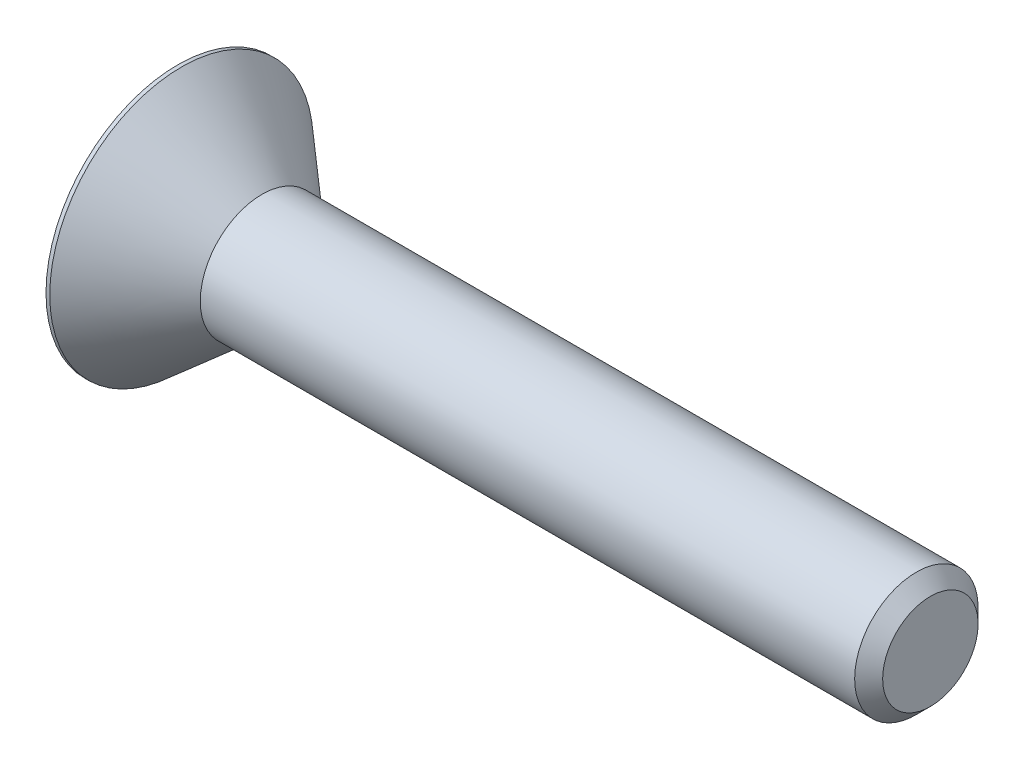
ISO-10303-21;
HEADER;
FILE_DESCRIPTION(('STEP AP214'),'2;1');
FILE_NAME('part.step','',(''),(''),'','','');
FILE_SCHEMA(('AUTOMOTIVE_DESIGN { 1 0 10303 214 1 1 1 1 }'));
ENDSEC;
DATA;
#1=APPLICATION_CONTEXT('core data for automotive mechanical design processes');
#2=APPLICATION_PROTOCOL_DEFINITION('international standard','automotive_design',2000,#1);
#3=PRODUCT_CONTEXT('',#1,'mechanical');
#4=PRODUCT('Part','Part','',(#3));
#5=PRODUCT_RELATED_PRODUCT_CATEGORY('part','',(#4));
#6=PRODUCT_DEFINITION_FORMATION('','',#4);
#7=PRODUCT_DEFINITION_CONTEXT('part definition',#1,'design');
#8=PRODUCT_DEFINITION('design','',#6,#7);
#9=PRODUCT_DEFINITION_SHAPE('','',#8);
#10=(LENGTH_UNIT() NAMED_UNIT(*) SI_UNIT(.MILLI.,.METRE.));
#11=(NAMED_UNIT(*) PLANE_ANGLE_UNIT() SI_UNIT($,.RADIAN.));
#12=(NAMED_UNIT(*) SI_UNIT($,.STERADIAN.) SOLID_ANGLE_UNIT());
#13=UNCERTAINTY_MEASURE_WITH_UNIT(LENGTH_MEASURE(1.E-05),#10,'distance_accuracy_value','');
#14=(GEOMETRIC_REPRESENTATION_CONTEXT(3) GLOBAL_UNCERTAINTY_ASSIGNED_CONTEXT((#13)) GLOBAL_UNIT_ASSIGNED_CONTEXT((#10,
#11,#12)) REPRESENTATION_CONTEXT('',''));
#15=CARTESIAN_POINT('',(0.,0.,0.));
#16=DIRECTION('',(0.,0.,1.));
#17=DIRECTION('',(1.,0.,0.));
#18=AXIS2_PLACEMENT_3D('',#15,#16,#17);
#19=CARTESIAN_POINT('',(0.,0.,0.));
#20=DIRECTION('',(-1.,0.,0.));
#21=DIRECTION('',(0.,0.,1.));
#22=AXIS2_PLACEMENT_3D('',#19,#20,#21);
#23=PLANE('',#22);
#24=CARTESIAN_POINT('',(0.,0.,0.));
#25=DIRECTION('',(-1.,0.,0.));
#26=DIRECTION('',(0.,0.,1.));
#27=AXIS2_PLACEMENT_3D('',#24,#25,#26);
#28=CIRCLE('',#27,4.445);
#29=CARTESIAN_POINT('',(0.,0.,4.445));
#30=VERTEX_POINT('',#29);
#31=EDGE_CURVE('E11',#30,#30,#28,.T.);
#32=ORIENTED_EDGE('',*,*,#31,.T.);
#33=EDGE_LOOP('',(#32));
#34=FACE_BOUND('',#33,.T.);
#35=DIRECTION('',(0.,-0.5,-0.866025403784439));
#36=VECTOR('',#35,1.);
#37=CARTESIAN_POINT('',(0.,-0.689240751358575,1.1938));
#38=LINE('',#37,#36);
#39=CARTESIAN_POINT('',(0.,-0.689240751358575,1.1938));
#40=VERTEX_POINT('',#39);
#41=CARTESIAN_POINT('',(0.,-1.37848150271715,0.));
#42=VERTEX_POINT('',#41);
#43=EDGE_CURVE('E116',#40,#42,#38,.T.);
#44=ORIENTED_EDGE('',*,*,#43,.T.);
#45=DIRECTION('',(0.,0.5,-0.866025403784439));
#46=VECTOR('',#45,1.);
#47=CARTESIAN_POINT('',(0.,-1.37848150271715,0.));
#48=LINE('',#47,#46);
#49=CARTESIAN_POINT('',(0.,-0.689240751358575,-1.1938));
#50=VERTEX_POINT('',#49);
#51=EDGE_CURVE('E47',#42,#50,#48,.T.);
#52=ORIENTED_EDGE('',*,*,#51,.T.);
#53=DIRECTION('',(0.,1.,0.));
#54=VECTOR('',#53,1.);
#55=CARTESIAN_POINT('',(0.,-0.689240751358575,-1.1938));
#56=LINE('',#55,#54);
#57=CARTESIAN_POINT('',(0.,0.689240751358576,-1.1938));
#58=VERTEX_POINT('',#57);
#59=EDGE_CURVE('E127',#50,#58,#56,.T.);
#60=ORIENTED_EDGE('',*,*,#59,.T.);
#61=DIRECTION('',(0.,0.5,0.866025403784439));
#62=VECTOR('',#61,1.);
#63=CARTESIAN_POINT('',(0.,0.689240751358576,-1.1938));
#64=LINE('',#63,#62);
#65=CARTESIAN_POINT('',(0.,1.37848150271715,0.));
#66=VERTEX_POINT('',#65);
#67=EDGE_CURVE('E198',#58,#66,#64,.T.);
#68=ORIENTED_EDGE('',*,*,#67,.T.);
#69=DIRECTION('',(0.,-0.5,0.866025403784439));
#70=VECTOR('',#69,1.);
#71=CARTESIAN_POINT('',(0.,1.37848150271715,0.));
#72=LINE('',#71,#70);
#73=CARTESIAN_POINT('',(0.,0.689240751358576,1.1938));
#74=VERTEX_POINT('',#73);
#75=EDGE_CURVE('E181',#66,#74,#72,.T.);
#76=ORIENTED_EDGE('',*,*,#75,.T.);
#77=DIRECTION('',(0.,-1.,0.));
#78=VECTOR('',#77,1.);
#79=CARTESIAN_POINT('',(0.,0.689240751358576,1.1938));
#80=LINE('',#79,#78);
#81=EDGE_CURVE('E176',#74,#40,#80,.T.);
#82=ORIENTED_EDGE('',*,*,#81,.T.);
#83=EDGE_LOOP('',(#44,#52,#60,#68,#76,#82));
#84=FACE_BOUND('',#83,.T.);
#85=ADVANCED_FACE('F33',(#34,#84),#23,.T.);
#86=CARTESIAN_POINT('',(0.,0.,0.));
#87=DIRECTION('',(-1.,0.,0.));
#88=DIRECTION('',(0.,0.,1.));
#89=AXIS2_PLACEMENT_3D('',#86,#87,#88);
#90=CYLINDRICAL_SURFACE('',#89,4.445);
#91=CARTESIAN_POINT('',(0.127,0.,0.));
#92=DIRECTION('',(-1.,0.,0.));
#93=DIRECTION('',(0.,0.,1.));
#94=AXIS2_PLACEMENT_3D('',#91,#92,#93);
#95=CIRCLE('',#94,4.445);
#96=CARTESIAN_POINT('',(0.127,0.,4.445));
#97=VERTEX_POINT('',#96);
#98=EDGE_CURVE('E40',#97,#97,#95,.T.);
#99=ORIENTED_EDGE('',*,*,#98,.T.);
#100=EDGE_LOOP('',(#99));
#101=FACE_BOUND('',#100,.T.);
#102=ORIENTED_EDGE('',*,*,#31,.F.);
#103=EDGE_LOOP('',(#102));
#104=FACE_BOUND('',#103,.T.);
#105=ADVANCED_FACE('F152',(#101,#104),#90,.T.);
#106=CARTESIAN_POINT('',(0.127,0.,0.));
#107=DIRECTION('',(-1.,0.,0.));
#108=DIRECTION('',(0.,0.,1.));
#109=AXIS2_PLACEMENT_3D('',#106,#107,#108);
#110=CONICAL_SURFACE('',#109,4.445,0.715584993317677);
#111=CARTESIAN_POINT('',(2.84440025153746,0.,0.));
#112=DIRECTION('',(-1.,0.,0.));
#113=DIRECTION('',(0.,0.,1.));
#114=AXIS2_PLACEMENT_3D('',#111,#112,#113);
#115=CIRCLE('',#114,2.0828);
#116=CARTESIAN_POINT('',(2.84440025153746,0.,2.0828));
#117=VERTEX_POINT('',#116);
#118=EDGE_CURVE('E147',#117,#117,#115,.T.);
#119=ORIENTED_EDGE('',*,*,#118,.T.);
#120=EDGE_LOOP('',(#119));
#121=FACE_BOUND('',#120,.T.);
#122=ORIENTED_EDGE('',*,*,#98,.F.);
#123=EDGE_LOOP('',(#122));
#124=FACE_BOUND('',#123,.T.);
#125=ADVANCED_FACE('F155',(#121,#124),#110,.T.);
#126=CARTESIAN_POINT('',(0.,0.,0.));
#127=DIRECTION('',(-1.,0.,0.));
#128=DIRECTION('',(0.,0.,1.));
#129=AXIS2_PLACEMENT_3D('',#126,#127,#128);
#130=CYLINDRICAL_SURFACE('',#129,2.08279999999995);
#131=CARTESIAN_POINT('',(24.9275599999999,0.,0.));
#132=DIRECTION('',(-1.,0.,0.));
#133=DIRECTION('',(0.,0.,1.));
#134=AXIS2_PLACEMENT_3D('',#131,#132,#133);
#135=CIRCLE('',#134,2.08279999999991);
#136=CARTESIAN_POINT('',(24.9275599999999,0.,2.08279999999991));
#137=VERTEX_POINT('',#136);
#138=EDGE_CURVE('E144',#137,#137,#135,.T.);
#139=ORIENTED_EDGE('',*,*,#138,.T.);
#140=EDGE_LOOP('',(#139));
#141=FACE_BOUND('',#140,.T.);
#142=ORIENTED_EDGE('',*,*,#118,.F.);
#143=EDGE_LOOP('',(#142));
#144=FACE_BOUND('',#143,.T.);
#145=ADVANCED_FACE('F157',(#141,#144),#130,.T.);
#146=CARTESIAN_POINT('',(25.4,0.,0.));
#147=DIRECTION('',(-1.,0.,0.));
#148=DIRECTION('',(0.,0.,1.));
#149=AXIS2_PLACEMENT_3D('',#146,#147,#148);
#150=CONICAL_SURFACE('',#149,1.61036,0.785398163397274);
#151=ORIENTED_EDGE('',*,*,#138,.F.);
#152=EDGE_LOOP('',(#151));
#153=FACE_BOUND('',#152,.T.);
#154=CARTESIAN_POINT('',(25.4,0.,0.));
#155=DIRECTION('',(-1.,0.,0.));
#156=DIRECTION('',(0.,0.,1.));
#157=AXIS2_PLACEMENT_3D('',#154,#155,#156);
#158=CIRCLE('',#157,1.61036);
#159=CARTESIAN_POINT('',(25.4,0.,1.61036));
#160=VERTEX_POINT('',#159);
#161=EDGE_CURVE('E140',#160,#160,#158,.T.);
#162=ORIENTED_EDGE('',*,*,#161,.T.);
#163=EDGE_LOOP('',(#162));
#164=FACE_BOUND('',#163,.T.);
#165=ADVANCED_FACE('F164',(#153,#164),#150,.T.);
#166=CARTESIAN_POINT('',(25.4,1.61036,0.));
#167=DIRECTION('',(1.,0.,0.));
#168=DIRECTION('',(0.,0.,-1.));
#169=AXIS2_PLACEMENT_3D('',#166,#167,#168);
#170=PLANE('',#169);
#171=ORIENTED_EDGE('',*,*,#161,.F.);
#172=EDGE_LOOP('',(#171));
#173=FACE_BOUND('',#172,.T.);
#174=ADVANCED_FACE('F264',(#173),#170,.T.);
#175=CARTESIAN_POINT('',(1.9304,-1.37848150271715,0.));
#176=DIRECTION('',(0.,0.866025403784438,0.5));
#177=DIRECTION('',(0.,-0.5,0.866025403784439));
#178=AXIS2_PLACEMENT_3D('',#175,#176,#177);
#179=PLANE('',#178);
#180=ORIENTED_EDGE('',*,*,#51,.F.);
#181=DIRECTION('',(-1.,0.,0.));
#182=VECTOR('',#181,1.);
#183=CARTESIAN_POINT('',(1.9304,-1.37848150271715,0.));
#184=LINE('',#183,#182);
#185=CARTESIAN_POINT('',(1.9304,-1.37848150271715,0.));
#186=VERTEX_POINT('',#185);
#187=EDGE_CURVE('E185',#186,#42,#184,.T.);
#188=ORIENTED_EDGE('',*,*,#187,.F.);
#189=DIRECTION('',(0.,0.5,-0.866025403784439));
#190=VECTOR('',#189,1.);
#191=CARTESIAN_POINT('',(1.9304,-1.37848150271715,0.));
#192=LINE('',#191,#190);
#193=CARTESIAN_POINT('',(1.9304,-1.03386112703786,-0.5969));
#194=VERTEX_POINT('',#193);
#195=EDGE_CURVE('E112',#186,#194,#192,.T.);
#196=ORIENTED_EDGE('',*,*,#195,.T.);
#197=CARTESIAN_POINT('',(1.9304,-0.689240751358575,-1.1938));
#198=VERTEX_POINT('',#197);
#199=EDGE_CURVE('E108',#194,#198,#192,.T.);
#200=ORIENTED_EDGE('',*,*,#199,.T.);
#201=DIRECTION('',(-1.,0.,0.));
#202=VECTOR('',#201,1.);
#203=CARTESIAN_POINT('',(1.9304,-0.689240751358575,-1.1938));
#204=LINE('',#203,#202);
#205=EDGE_CURVE('E110',#198,#50,#204,.T.);
#206=ORIENTED_EDGE('',*,*,#205,.T.);
#207=EDGE_LOOP('',(#180,#188,#196,#200,#206));
#208=FACE_BOUND('',#207,.T.);
#209=ADVANCED_FACE('F109',(#208),#179,.T.);
#210=CARTESIAN_POINT('',(1.9304,-0.689240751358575,-1.1938));
#211=DIRECTION('',(0.,0.,1.));
#212=DIRECTION('',(1.,0.,0.));
#213=AXIS2_PLACEMENT_3D('',#210,#211,#212);
#214=PLANE('',#213);
#215=ORIENTED_EDGE('',*,*,#59,.F.);
#216=ORIENTED_EDGE('',*,*,#205,.F.);
#217=DIRECTION('',(0.,1.,0.));
#218=VECTOR('',#217,1.);
#219=CARTESIAN_POINT('',(1.9304,-0.689240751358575,-1.1938));
#220=LINE('',#219,#218);
#221=CARTESIAN_POINT('',(1.9304,0.,-1.1938));
#222=VERTEX_POINT('',#221);
#223=EDGE_CURVE('E55',#198,#222,#220,.T.);
#224=ORIENTED_EDGE('',*,*,#223,.T.);
#225=CARTESIAN_POINT('',(1.9304,0.689240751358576,-1.1938));
#226=VERTEX_POINT('',#225);
#227=EDGE_CURVE('E122',#222,#226,#220,.T.);
#228=ORIENTED_EDGE('',*,*,#227,.T.);
#229=DIRECTION('',(-1.,0.,0.));
#230=VECTOR('',#229,1.);
#231=CARTESIAN_POINT('',(1.9304,0.689240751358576,-1.1938));
#232=LINE('',#231,#230);
#233=EDGE_CURVE('E129',#226,#58,#232,.T.);
#234=ORIENTED_EDGE('',*,*,#233,.T.);
#235=EDGE_LOOP('',(#215,#216,#224,#228,#234));
#236=FACE_BOUND('',#235,.T.);
#237=ADVANCED_FACE('F124',(#236),#214,.T.);
#238=CARTESIAN_POINT('',(1.9304,0.689240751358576,-1.1938));
#239=DIRECTION('',(0.,-0.866025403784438,0.5));
#240=DIRECTION('',(0.,-0.5,-0.866025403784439));
#241=AXIS2_PLACEMENT_3D('',#238,#239,#240);
#242=PLANE('',#241);
#243=ORIENTED_EDGE('',*,*,#67,.F.);
#244=ORIENTED_EDGE('',*,*,#233,.F.);
#245=DIRECTION('',(0.,0.5,0.866025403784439));
#246=VECTOR('',#245,1.);
#247=CARTESIAN_POINT('',(1.9304,0.689240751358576,-1.1938));
#248=LINE('',#247,#246);
#249=CARTESIAN_POINT('',(1.9304,1.03386112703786,-0.5969));
#250=VERTEX_POINT('',#249);
#251=EDGE_CURVE('E218',#226,#250,#248,.T.);
#252=ORIENTED_EDGE('',*,*,#251,.T.);
#253=CARTESIAN_POINT('',(1.9304,1.37848150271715,0.));
#254=VERTEX_POINT('',#253);
#255=EDGE_CURVE('E121',#250,#254,#248,.T.);
#256=ORIENTED_EDGE('',*,*,#255,.T.);
#257=DIRECTION('',(-1.,0.,0.));
#258=VECTOR('',#257,1.);
#259=CARTESIAN_POINT('',(1.9304,1.37848150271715,0.));
#260=LINE('',#259,#258);
#261=EDGE_CURVE('E135',#254,#66,#260,.T.);
#262=ORIENTED_EDGE('',*,*,#261,.T.);
#263=EDGE_LOOP('',(#243,#244,#252,#256,#262));
#264=FACE_BOUND('',#263,.T.);
#265=ADVANCED_FACE('F196',(#264),#242,.T.);
#266=CARTESIAN_POINT('',(1.9304,1.37848150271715,0.));
#267=DIRECTION('',(0.,-0.866025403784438,-0.5));
#268=DIRECTION('',(0.,0.5,-0.866025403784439));
#269=AXIS2_PLACEMENT_3D('',#266,#267,#268);
#270=PLANE('',#269);
#271=ORIENTED_EDGE('',*,*,#75,.F.);
#272=ORIENTED_EDGE('',*,*,#261,.F.);
#273=DIRECTION('',(0.,-0.5,0.866025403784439));
#274=VECTOR('',#273,1.);
#275=CARTESIAN_POINT('',(1.9304,1.37848150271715,0.));
#276=LINE('',#275,#274);
#277=CARTESIAN_POINT('',(1.9304,1.03386112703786,0.5969));
#278=VERTEX_POINT('',#277);
#279=EDGE_CURVE('E215',#254,#278,#276,.T.);
#280=ORIENTED_EDGE('',*,*,#279,.T.);
#281=CARTESIAN_POINT('',(1.9304,0.689240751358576,1.1938));
#282=VERTEX_POINT('',#281);
#283=EDGE_CURVE('E217',#278,#282,#276,.T.);
#284=ORIENTED_EDGE('',*,*,#283,.T.);
#285=DIRECTION('',(-1.,0.,0.));
#286=VECTOR('',#285,1.);
#287=CARTESIAN_POINT('',(1.9304,0.689240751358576,1.1938));
#288=LINE('',#287,#286);
#289=EDGE_CURVE('E190',#282,#74,#288,.T.);
#290=ORIENTED_EDGE('',*,*,#289,.T.);
#291=EDGE_LOOP('',(#271,#272,#280,#284,#290));
#292=FACE_BOUND('',#291,.T.);
#293=ADVANCED_FACE('F228',(#292),#270,.T.);
#294=CARTESIAN_POINT('',(1.9304,0.689240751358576,1.1938));
#295=DIRECTION('',(0.,0.,-1.));
#296=DIRECTION('',(-1.,0.,0.));
#297=AXIS2_PLACEMENT_3D('',#294,#295,#296);
#298=PLANE('',#297);
#299=ORIENTED_EDGE('',*,*,#81,.F.);
#300=ORIENTED_EDGE('',*,*,#289,.F.);
#301=DIRECTION('',(0.,-1.,0.));
#302=VECTOR('',#301,1.);
#303=CARTESIAN_POINT('',(1.9304,0.689240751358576,1.1938));
#304=LINE('',#303,#302);
#305=CARTESIAN_POINT('',(1.9304,0.,1.1938));
#306=VERTEX_POINT('',#305);
#307=EDGE_CURVE('E211',#282,#306,#304,.T.);
#308=ORIENTED_EDGE('',*,*,#307,.T.);
#309=CARTESIAN_POINT('',(1.9304,-0.689240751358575,1.1938));
#310=VERTEX_POINT('',#309);
#311=EDGE_CURVE('E214',#306,#310,#304,.T.);
#312=ORIENTED_EDGE('',*,*,#311,.T.);
#313=DIRECTION('',(-1.,0.,0.));
#314=VECTOR('',#313,1.);
#315=CARTESIAN_POINT('',(1.9304,-0.689240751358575,1.1938));
#316=LINE('',#315,#314);
#317=EDGE_CURVE('E187',#310,#40,#316,.T.);
#318=ORIENTED_EDGE('',*,*,#317,.T.);
#319=EDGE_LOOP('',(#299,#300,#308,#312,#318));
#320=FACE_BOUND('',#319,.T.);
#321=ADVANCED_FACE('F241',(#320),#298,.T.);
#322=CARTESIAN_POINT('',(1.9304,-0.689240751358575,1.1938));
#323=DIRECTION('',(0.,0.866025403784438,-0.5));
#324=DIRECTION('',(0.,0.5,0.866025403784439));
#325=AXIS2_PLACEMENT_3D('',#322,#323,#324);
#326=PLANE('',#325);
#327=ORIENTED_EDGE('',*,*,#43,.F.);
#328=ORIENTED_EDGE('',*,*,#317,.F.);
#329=DIRECTION('',(0.,-0.5,-0.866025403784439));
#330=VECTOR('',#329,1.);
#331=CARTESIAN_POINT('',(1.9304,-0.689240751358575,1.1938));
#332=LINE('',#331,#330);
#333=CARTESIAN_POINT('',(1.9304,-1.03386112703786,0.5969));
#334=VERTEX_POINT('',#333);
#335=EDGE_CURVE('E188',#310,#334,#332,.T.);
#336=ORIENTED_EDGE('',*,*,#335,.T.);
#337=EDGE_CURVE('E210',#334,#186,#332,.T.);
#338=ORIENTED_EDGE('',*,*,#337,.T.);
#339=ORIENTED_EDGE('',*,*,#187,.T.);
#340=EDGE_LOOP('',(#327,#328,#336,#338,#339));
#341=FACE_BOUND('',#340,.T.);
#342=ADVANCED_FACE('F242',(#341),#326,.T.);
#343=CARTESIAN_POINT('',(1.9304,0.,-2.3876));
#344=DIRECTION('',(1.,0.,0.));
#345=DIRECTION('',(0.,0.,-1.));
#346=AXIS2_PLACEMENT_3D('',#343,#344,#345);
#347=PLANE('',#346);
#348=ORIENTED_EDGE('',*,*,#223,.F.);
#349=ORIENTED_EDGE('',*,*,#199,.F.);
#350=CARTESIAN_POINT('',(1.9304,0.,0.));
#351=DIRECTION('',(-1.,0.,0.));
#352=DIRECTION('',(0.,0.,1.));
#353=AXIS2_PLACEMENT_3D('',#350,#351,#352);
#354=CIRCLE('',#353,1.1938);
#355=EDGE_CURVE('E119',#222,#194,#354,.T.);
#356=ORIENTED_EDGE('',*,*,#355,.F.);
#357=EDGE_LOOP('',(#348,#349,#356));
#358=FACE_BOUND('',#357,.T.);
#359=ADVANCED_FACE('F118',(#358),#347,.F.);
#360=ORIENTED_EDGE('',*,*,#195,.F.);
#361=ORIENTED_EDGE('',*,*,#337,.F.);
#362=EDGE_CURVE('E132',#194,#334,#354,.T.);
#363=ORIENTED_EDGE('',*,*,#362,.F.);
#364=EDGE_LOOP('',(#360,#361,#363));
#365=FACE_BOUND('',#364,.T.);
#366=ADVANCED_FACE('F244',(#365),#347,.F.);
#367=ORIENTED_EDGE('',*,*,#335,.F.);
#368=ORIENTED_EDGE('',*,*,#311,.F.);
#369=EDGE_CURVE('E128',#334,#306,#354,.T.);
#370=ORIENTED_EDGE('',*,*,#369,.F.);
#371=EDGE_LOOP('',(#367,#368,#370));
#372=FACE_BOUND('',#371,.T.);
#373=ADVANCED_FACE('F238',(#372),#347,.F.);
#374=ORIENTED_EDGE('',*,*,#307,.F.);
#375=ORIENTED_EDGE('',*,*,#283,.F.);
#376=EDGE_CURVE('E134',#306,#278,#354,.T.);
#377=ORIENTED_EDGE('',*,*,#376,.F.);
#378=EDGE_LOOP('',(#374,#375,#377));
#379=FACE_BOUND('',#378,.T.);
#380=ADVANCED_FACE('F235',(#379),#347,.F.);
#381=ORIENTED_EDGE('',*,*,#279,.F.);
#382=ORIENTED_EDGE('',*,*,#255,.F.);
#383=EDGE_CURVE('E141',#278,#250,#354,.T.);
#384=ORIENTED_EDGE('',*,*,#383,.F.);
#385=EDGE_LOOP('',(#381,#382,#384));
#386=FACE_BOUND('',#385,.T.);
#387=ADVANCED_FACE('F226',(#386),#347,.F.);
#388=ORIENTED_EDGE('',*,*,#251,.F.);
#389=ORIENTED_EDGE('',*,*,#227,.F.);
#390=EDGE_CURVE('E223',#250,#222,#354,.T.);
#391=ORIENTED_EDGE('',*,*,#390,.F.);
#392=EDGE_LOOP('',(#388,#389,#391));
#393=FACE_BOUND('',#392,.T.);
#394=ADVANCED_FACE('F222',(#393),#347,.F.);
#395=CARTESIAN_POINT('',(1.9304,0.,0.));
#396=DIRECTION('',(-1.,0.,0.));
#397=DIRECTION('',(0.,0.,1.));
#398=AXIS2_PLACEMENT_3D('',#395,#396,#397);
#399=CONICAL_SURFACE('',#398,1.1938,1.04719755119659);
#400=CARTESIAN_POINT('',(2.61964075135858,0.,0.));
#401=VERTEX_POINT('',#400);
#402=VERTEX_LOOP('',#401);
#403=FACE_BOUND('',#402,.T.);
#404=ORIENTED_EDGE('',*,*,#376,.T.);
#405=ORIENTED_EDGE('',*,*,#383,.T.);
#406=ORIENTED_EDGE('',*,*,#390,.T.);
#407=ORIENTED_EDGE('',*,*,#355,.T.);
#408=ORIENTED_EDGE('',*,*,#362,.T.);
#409=ORIENTED_EDGE('',*,*,#369,.T.);
#410=EDGE_LOOP('',(#404,#405,#406,#407,#408,#409));
#411=FACE_BOUND('',#410,.T.);
#412=ADVANCED_FACE('F230',(#403,#411),#399,.F.);
#413=CLOSED_SHELL('',(#85,#105,#125,#145,#165,#174,#209,#237,#265,#293,#321,#342,#359,#366,#373,
#380,#387,#394,#412));
#414=MANIFOLD_SOLID_BREP('B2',#413);
#415=ADVANCED_BREP_SHAPE_REPRESENTATION('',(#18,#414),#14);
#416=SHAPE_DEFINITION_REPRESENTATION(#9,#415);
ENDSEC;
END-ISO-10303-21;
